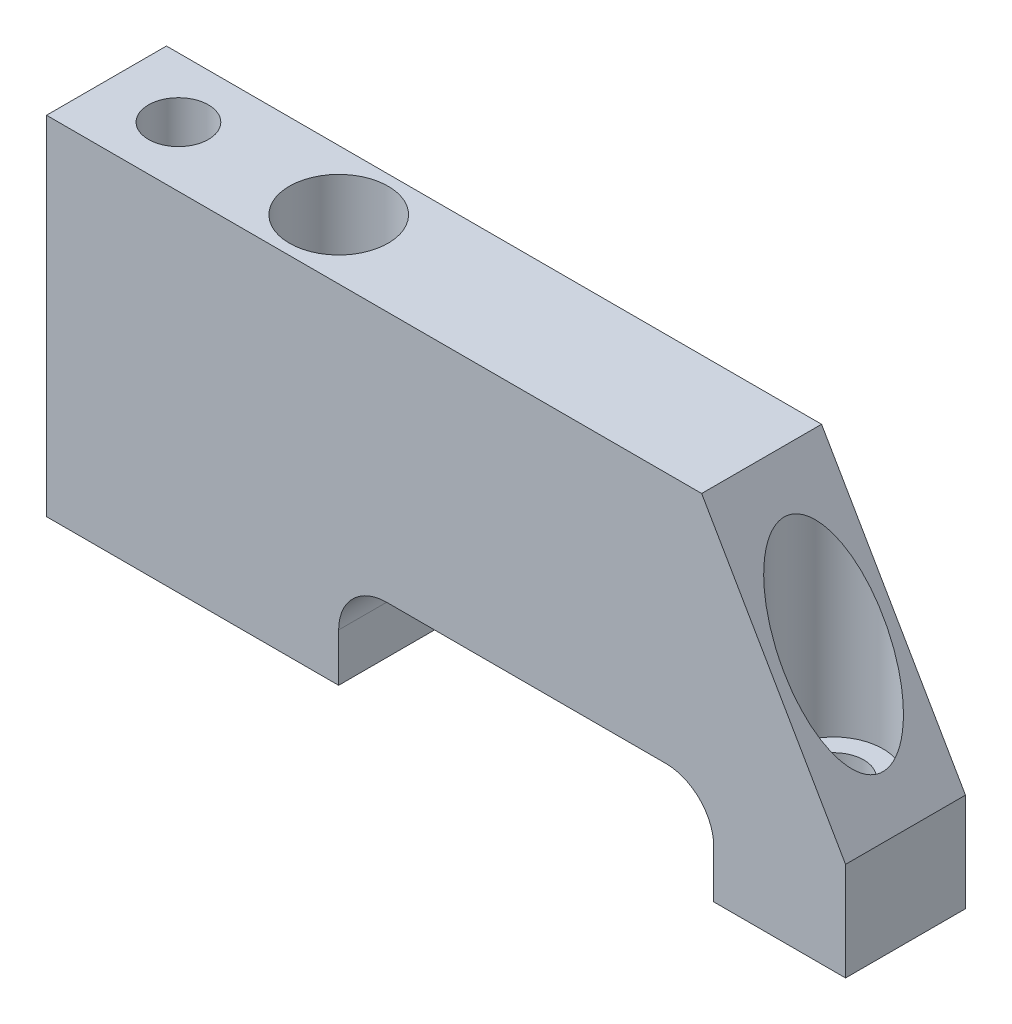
from build123d import *

# Parameters (mm, degrees)
BOSS_EXTRUDE1_DEPTH                               = 7.9375
FILLET1_R                                         = 6.35
CBORE_FOR_5_16_SOCKET_HEAD_CAP_SCREW2_D           = 8.001
CBORE_FOR_5_16_SOCKET_HEAD_CAP_SCREW2_CBORE_D     = 13.081
CBORE_FOR_5_16_SOCKET_HEAD_CAP_SCREW2_CBORE_DEPTH = 31.75
F_5_16_0_3125_DIAMETER_HOLE1_D                    = 7.9375
F_5_16_0_3125_DIAMETER_HOLE1_DEPTH                = 20.32
F_5_16_0_3125_DIAMETER_HOLE1_TIP                  = 2.384665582
CUT_EXTRUDE1_DEPTH                                = 79.825986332
CUT_EXTRUDE1_DEPTH_BACK                           = 79.825986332


with BuildPart() as part:
    # Sketch2 → Boss-Extrude1 (new, symmetric)
    with BuildSketch(Plane.XY):
        Polygon((-63.5, 0), (-24.8285, 0), (-24.8285, 12.7), (24.8285, 12.7), (24.8285, 0), (42.2783, 0), (42.2783, 46.0248), (-63.5, 46.0248), align=None)
    extrude(amount=BOSS_EXTRUDE1_DEPTH, both=True)

    # Fillet1
    fillet1_edges = [part.edges().sort_by_distance(p)[0] for p in [
        (24.8285, 12.7, 0),
        (-24.8285, 12.7, 0),
    ]]
    fillet(fillet1_edges, radius=FILLET1_R)

    # CBORE for 5_16 Socket Head Cap Screw2 (through all)
    with Locations(Plane(origin=(0, 46.0248, 0), x_dir=(1, 0, 0), z_dir=(0, 1, 0))):
        with Locations((32.7533, 0), (-32.7533, 0)):
            CounterBoreHole(CBORE_FOR_5_16_SOCKET_HEAD_CAP_SCREW2_D / 2, CBORE_FOR_5_16_SOCKET_HEAD_CAP_SCREW2_CBORE_D / 2, CBORE_FOR_5_16_SOCKET_HEAD_CAP_SCREW2_CBORE_DEPTH)

    # 5_16 _0.3125_ Diameter Hole1
    with Locations(Plane(origin=(0, 46.0248, 0), x_dir=(1, 0, 0), z_dir=(0, 1, 0))):
        with Locations((-53.975, 0)):
            Hole(F_5_16_0_3125_DIAMETER_HOLE1_D / 2, depth=F_5_16_0_3125_DIAMETER_HOLE1_DEPTH)
            with Locations((0, 0, -(F_5_16_0_3125_DIAMETER_HOLE1_DEPTH + F_5_16_0_3125_DIAMETER_HOLE1_TIP / 2))):  # 118° drill point
                Cone(0, F_5_16_0_3125_DIAMETER_HOLE1_D / 2, F_5_16_0_3125_DIAMETER_HOLE1_TIP, mode=Mode.SUBTRACT)

    # Sketch12 → Cut-Extrude1 (cut, two sides: drawn at the far end of the back side and taken through both)
    with BuildSketch(Plane.XY.offset(-CUT_EXTRUDE1_DEPTH_BACK)):
        Polygon((-92.576737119, 246.605008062), (23.2283, 46.0248), (42.2783, 13.029232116), (158.083337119, -187.550975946), (559.243753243, 44.059098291), (308.583679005, 478.2150823), align=None)
    extrude(amount=CUT_EXTRUDE1_DEPTH + CUT_EXTRUDE1_DEPTH_BACK, mode=Mode.SUBTRACT)


solid = part.part
